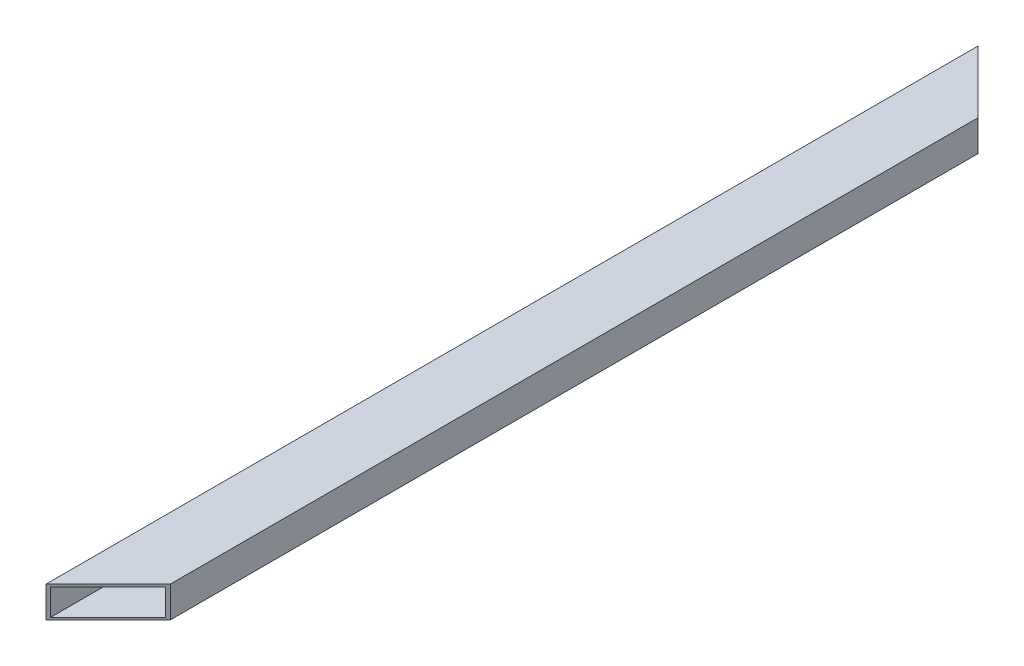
ISO-10303-21;
HEADER;
FILE_DESCRIPTION(('STEP AP214'),'2;1');
FILE_NAME('part.step','',(''),(''),'','','');
FILE_SCHEMA(('AUTOMOTIVE_DESIGN { 1 0 10303 214 1 1 1 1 }'));
ENDSEC;
DATA;
#1=APPLICATION_CONTEXT('core data for automotive mechanical design processes');
#2=APPLICATION_PROTOCOL_DEFINITION('international standard','automotive_design',2000,#1);
#3=PRODUCT_CONTEXT('',#1,'mechanical');
#4=PRODUCT('Part','Part','',(#3));
#5=PRODUCT_RELATED_PRODUCT_CATEGORY('part','',(#4));
#6=PRODUCT_DEFINITION_FORMATION('','',#4);
#7=PRODUCT_DEFINITION_CONTEXT('part definition',#1,'design');
#8=PRODUCT_DEFINITION('design','',#6,#7);
#9=PRODUCT_DEFINITION_SHAPE('','',#8);
#10=(LENGTH_UNIT() NAMED_UNIT(*) SI_UNIT(.MILLI.,.METRE.));
#11=(NAMED_UNIT(*) PLANE_ANGLE_UNIT() SI_UNIT($,.RADIAN.));
#12=(NAMED_UNIT(*) SI_UNIT($,.STERADIAN.) SOLID_ANGLE_UNIT());
#13=UNCERTAINTY_MEASURE_WITH_UNIT(LENGTH_MEASURE(1.E-05),#10,'distance_accuracy_value','');
#14=(GEOMETRIC_REPRESENTATION_CONTEXT(3) GLOBAL_UNCERTAINTY_ASSIGNED_CONTEXT((#13)) GLOBAL_UNIT_ASSIGNED_CONTEXT((#10,
#11,#12)) REPRESENTATION_CONTEXT('',''));
#15=CARTESIAN_POINT('',(0.,0.,0.));
#16=DIRECTION('',(0.,0.,1.));
#17=DIRECTION('',(1.,0.,0.));
#18=AXIS2_PLACEMENT_3D('',#15,#16,#17);
#19=CARTESIAN_POINT('',(0.,0.,1200.));
#20=DIRECTION('',(1.,0.,0.));
#21=DIRECTION('',(0.,1.,0.));
#22=AXIS2_PLACEMENT_3D('',#19,#20,#21);
#23=PLANE('',#22);
#24=DIRECTION('',(0.,-1.,0.));
#25=VECTOR('',#24,1.);
#26=CARTESIAN_POINT('',(0.,0.,0.));
#27=LINE('',#26,#25);
#28=CARTESIAN_POINT('',(0.,40.,0.));
#29=VERTEX_POINT('',#28);
#30=CARTESIAN_POINT('',(0.,0.,0.));
#31=VERTEX_POINT('',#30);
#32=EDGE_CURVE('E88',#29,#31,#27,.T.);
#33=ORIENTED_EDGE('',*,*,#32,.T.);
#34=DIRECTION('',(0.,0.,-1.));
#35=VECTOR('',#34,1.);
#36=CARTESIAN_POINT('',(0.,0.,1200.));
#37=LINE('',#36,#35);
#38=CARTESIAN_POINT('',(0.,0.,1200.));
#39=VERTEX_POINT('',#38);
#40=EDGE_CURVE('E124',#39,#31,#37,.T.);
#41=ORIENTED_EDGE('',*,*,#40,.F.);
#42=DIRECTION('',(0.,-1.,0.));
#43=VECTOR('',#42,1.);
#44=CARTESIAN_POINT('',(0.,0.,1200.));
#45=LINE('',#44,#43);
#46=CARTESIAN_POINT('',(0.,40.,1200.));
#47=VERTEX_POINT('',#46);
#48=EDGE_CURVE('E134',#47,#39,#45,.T.);
#49=ORIENTED_EDGE('',*,*,#48,.F.);
#50=DIRECTION('',(0.,0.,-1.));
#51=VECTOR('',#50,1.);
#52=CARTESIAN_POINT('',(0.,40.,1200.));
#53=LINE('',#52,#51);
#54=EDGE_CURVE('E131',#47,#29,#53,.T.);
#55=ORIENTED_EDGE('',*,*,#54,.T.);
#56=EDGE_LOOP('',(#33,#41,#49,#55));
#57=FACE_BOUND('',#56,.T.);
#58=ADVANCED_FACE('F32',(#57),#23,.F.);
#59=CARTESIAN_POINT('',(0.,0.,1200.));
#60=DIRECTION('',(0.,1.,0.));
#61=DIRECTION('',(0.,0.,1.));
#62=AXIS2_PLACEMENT_3D('',#59,#60,#61);
#63=PLANE('',#62);
#64=ORIENTED_EDGE('',*,*,#40,.T.);
#65=DIRECTION('',(0.707106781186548,0.,0.707106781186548));
#66=VECTOR('',#65,1.);
#67=CARTESIAN_POINT('',(80.,0.,80.0000000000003));
#68=LINE('',#67,#66);
#69=CARTESIAN_POINT('',(80.0000000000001,0.,80.0000000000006));
#70=VERTEX_POINT('',#69);
#71=EDGE_CURVE('E11',#31,#70,#68,.T.);
#72=ORIENTED_EDGE('',*,*,#71,.T.);
#73=DIRECTION('',(0.,0.,-1.));
#74=VECTOR('',#73,1.);
#75=CARTESIAN_POINT('',(80.,0.,1200.));
#76=LINE('',#75,#74);
#77=CARTESIAN_POINT('',(80.,0.,1120.));
#78=VERTEX_POINT('',#77);
#79=EDGE_CURVE('E126',#78,#70,#76,.T.);
#80=ORIENTED_EDGE('',*,*,#79,.F.);
#81=DIRECTION('',(0.707106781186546,0.,-0.707106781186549));
#82=VECTOR('',#81,1.);
#83=CARTESIAN_POINT('',(-1.94289029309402E-13,0.,1200.));
#84=LINE('',#83,#82);
#85=EDGE_CURVE('E107',#78,#39,#84,.F.);
#86=ORIENTED_EDGE('',*,*,#85,.T.);
#87=EDGE_LOOP('',(#64,#72,#80,#86));
#88=FACE_BOUND('',#87,.T.);
#89=ADVANCED_FACE('F166',(#88),#63,.F.);
#90=CARTESIAN_POINT('',(80.,0.,1200.));
#91=DIRECTION('',(-1.,0.,0.));
#92=DIRECTION('',(0.,0.,1.));
#93=AXIS2_PLACEMENT_3D('',#90,#91,#92);
#94=PLANE('',#93);
#95=ORIENTED_EDGE('',*,*,#79,.T.);
#96=DIRECTION('',(0.,1.,0.));
#97=VECTOR('',#96,1.);
#98=CARTESIAN_POINT('',(80.,40.,80.0000000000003));
#99=LINE('',#98,#97);
#100=CARTESIAN_POINT('',(80.0000000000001,40.,80.0000000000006));
#101=VERTEX_POINT('',#100);
#102=EDGE_CURVE('E104',#70,#101,#99,.T.);
#103=ORIENTED_EDGE('',*,*,#102,.T.);
#104=DIRECTION('',(0.,0.,-1.));
#105=VECTOR('',#104,1.);
#106=CARTESIAN_POINT('',(80.,40.,1200.));
#107=LINE('',#106,#105);
#108=CARTESIAN_POINT('',(80.,40.,1120.));
#109=VERTEX_POINT('',#108);
#110=EDGE_CURVE('E128',#109,#101,#107,.T.);
#111=ORIENTED_EDGE('',*,*,#110,.F.);
#112=DIRECTION('',(0.,-1.,0.));
#113=VECTOR('',#112,1.);
#114=CARTESIAN_POINT('',(80.,0.,1120.));
#115=LINE('',#114,#113);
#116=EDGE_CURVE('E118',#109,#78,#115,.T.);
#117=ORIENTED_EDGE('',*,*,#116,.T.);
#118=EDGE_LOOP('',(#95,#103,#111,#117));
#119=FACE_BOUND('',#118,.T.);
#120=ADVANCED_FACE('F176',(#119),#94,.F.);
#121=CARTESIAN_POINT('',(0.,40.,1200.));
#122=DIRECTION('',(0.,-1.,0.));
#123=DIRECTION('',(0.,0.,-1.));
#124=AXIS2_PLACEMENT_3D('',#121,#122,#123);
#125=PLANE('',#124);
#126=ORIENTED_EDGE('',*,*,#110,.T.);
#127=DIRECTION('',(-0.707106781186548,0.,-0.707106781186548));
#128=VECTOR('',#127,1.);
#129=CARTESIAN_POINT('',(80.,40.,80.0000000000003));
#130=LINE('',#129,#128);
#131=EDGE_CURVE('E42',#101,#29,#130,.T.);
#132=ORIENTED_EDGE('',*,*,#131,.T.);
#133=ORIENTED_EDGE('',*,*,#54,.F.);
#134=DIRECTION('',(-0.707106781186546,0.,0.707106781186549));
#135=VECTOR('',#134,1.);
#136=CARTESIAN_POINT('',(-1.94289029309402E-13,40.,1200.));
#137=LINE('',#136,#135);
#138=EDGE_CURVE('E121',#47,#109,#137,.F.);
#139=ORIENTED_EDGE('',*,*,#138,.T.);
#140=EDGE_LOOP('',(#126,#132,#133,#139));
#141=FACE_BOUND('',#140,.T.);
#142=ADVANCED_FACE('F179',(#141),#125,.F.);
#143=CARTESIAN_POINT('',(2.99999999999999,37.,1200.));
#144=DIRECTION('',(1.,0.,0.));
#145=DIRECTION('',(0.,1.,0.));
#146=AXIS2_PLACEMENT_3D('',#143,#144,#145);
#147=PLANE('',#146);
#148=DIRECTION('',(0.,-1.,0.));
#149=VECTOR('',#148,1.);
#150=CARTESIAN_POINT('',(3.,0.,3.00000000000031));
#151=LINE('',#150,#149);
#152=CARTESIAN_POINT('',(2.99999999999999,37.,3.00000000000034));
#153=VERTEX_POINT('',#152);
#154=CARTESIAN_POINT('',(3.,3.,3.00000000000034));
#155=VERTEX_POINT('',#154);
#156=EDGE_CURVE('E36',#153,#155,#151,.T.);
#157=ORIENTED_EDGE('',*,*,#156,.F.);
#158=DIRECTION('',(0.,0.,-1.));
#159=VECTOR('',#158,1.);
#160=CARTESIAN_POINT('',(2.99999999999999,37.,1200.));
#161=LINE('',#160,#159);
#162=CARTESIAN_POINT('',(2.99999999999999,37.,1197.));
#163=VERTEX_POINT('',#162);
#164=EDGE_CURVE('E111',#163,#153,#161,.T.);
#165=ORIENTED_EDGE('',*,*,#164,.F.);
#166=DIRECTION('',(0.,1.,0.));
#167=VECTOR('',#166,1.);
#168=CARTESIAN_POINT('',(2.99999999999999,37.,1197.));
#169=LINE('',#168,#167);
#170=CARTESIAN_POINT('',(3.,3.,1197.));
#171=VERTEX_POINT('',#170);
#172=EDGE_CURVE('E87',#163,#171,#169,.F.);
#173=ORIENTED_EDGE('',*,*,#172,.T.);
#174=DIRECTION('',(0.,0.,-1.));
#175=VECTOR('',#174,1.);
#176=CARTESIAN_POINT('',(3.,3.,1200.));
#177=LINE('',#176,#175);
#178=EDGE_CURVE('E71',#171,#155,#177,.T.);
#179=ORIENTED_EDGE('',*,*,#178,.T.);
#180=EDGE_LOOP('',(#157,#165,#173,#179));
#181=FACE_BOUND('',#180,.T.);
#182=ADVANCED_FACE('F83',(#181),#147,.T.);
#183=CARTESIAN_POINT('',(3.,3.,1200.));
#184=DIRECTION('',(0.,1.,0.));
#185=DIRECTION('',(0.,0.,1.));
#186=AXIS2_PLACEMENT_3D('',#183,#184,#185);
#187=PLANE('',#186);
#188=DIRECTION('',(0.707106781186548,0.,0.707106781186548));
#189=VECTOR('',#188,1.);
#190=CARTESIAN_POINT('',(80.,3.,80.0000000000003));
#191=LINE('',#190,#189);
#192=CARTESIAN_POINT('',(77.,3.,77.0000000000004));
#193=VERTEX_POINT('',#192);
#194=EDGE_CURVE('E67',#155,#193,#191,.T.);
#195=ORIENTED_EDGE('',*,*,#194,.F.);
#196=ORIENTED_EDGE('',*,*,#178,.F.);
#197=DIRECTION('',(-0.707106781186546,0.,0.707106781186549));
#198=VECTOR('',#197,1.);
#199=CARTESIAN_POINT('',(1.4999999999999,3.,1198.5));
#200=LINE('',#199,#198);
#201=CARTESIAN_POINT('',(77.,3.,1123.));
#202=VERTEX_POINT('',#201);
#203=EDGE_CURVE('E98',#171,#202,#200,.F.);
#204=ORIENTED_EDGE('',*,*,#203,.T.);
#205=DIRECTION('',(0.,0.,-1.));
#206=VECTOR('',#205,1.);
#207=CARTESIAN_POINT('',(77.,3.,1200.));
#208=LINE('',#207,#206);
#209=EDGE_CURVE('E74',#202,#193,#208,.T.);
#210=ORIENTED_EDGE('',*,*,#209,.T.);
#211=EDGE_LOOP('',(#195,#196,#204,#210));
#212=FACE_BOUND('',#211,.T.);
#213=ADVANCED_FACE('F69',(#212),#187,.T.);
#214=CARTESIAN_POINT('',(77.,37.,1200.));
#215=DIRECTION('',(-1.,0.,0.));
#216=DIRECTION('',(0.,0.,1.));
#217=AXIS2_PLACEMENT_3D('',#214,#215,#216);
#218=PLANE('',#217);
#219=DIRECTION('',(0.,1.,0.));
#220=VECTOR('',#219,1.);
#221=CARTESIAN_POINT('',(77.,0.,77.0000000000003));
#222=LINE('',#221,#220);
#223=CARTESIAN_POINT('',(77.,37.,77.0000000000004));
#224=VERTEX_POINT('',#223);
#225=EDGE_CURVE('E79',#193,#224,#222,.T.);
#226=ORIENTED_EDGE('',*,*,#225,.F.);
#227=ORIENTED_EDGE('',*,*,#209,.F.);
#228=DIRECTION('',(0.,-1.,0.));
#229=VECTOR('',#228,1.);
#230=CARTESIAN_POINT('',(77.,37.,1123.));
#231=LINE('',#230,#229);
#232=CARTESIAN_POINT('',(77.,37.,1123.));
#233=VERTEX_POINT('',#232);
#234=EDGE_CURVE('E112',#202,#233,#231,.F.);
#235=ORIENTED_EDGE('',*,*,#234,.T.);
#236=DIRECTION('',(0.,0.,-1.));
#237=VECTOR('',#236,1.);
#238=CARTESIAN_POINT('',(77.,37.,1200.));
#239=LINE('',#238,#237);
#240=EDGE_CURVE('E140',#233,#224,#239,.T.);
#241=ORIENTED_EDGE('',*,*,#240,.T.);
#242=EDGE_LOOP('',(#226,#227,#235,#241));
#243=FACE_BOUND('',#242,.T.);
#244=ADVANCED_FACE('F153',(#243),#218,.T.);
#245=CARTESIAN_POINT('',(2.99999999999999,37.,1200.));
#246=DIRECTION('',(0.,-1.,0.));
#247=DIRECTION('',(0.,0.,-1.));
#248=AXIS2_PLACEMENT_3D('',#245,#246,#247);
#249=PLANE('',#248);
#250=DIRECTION('',(-0.707106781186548,0.,-0.707106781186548));
#251=VECTOR('',#250,1.);
#252=CARTESIAN_POINT('',(80.,37.,80.0000000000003));
#253=LINE('',#252,#251);
#254=EDGE_CURVE('E92',#224,#153,#253,.T.);
#255=ORIENTED_EDGE('',*,*,#254,.F.);
#256=ORIENTED_EDGE('',*,*,#240,.F.);
#257=DIRECTION('',(0.707106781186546,0.,-0.707106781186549));
#258=VECTOR('',#257,1.);
#259=CARTESIAN_POINT('',(1.49999999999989,37.,1198.5));
#260=LINE('',#259,#258);
#261=EDGE_CURVE('E108',#233,#163,#260,.F.);
#262=ORIENTED_EDGE('',*,*,#261,.T.);
#263=ORIENTED_EDGE('',*,*,#164,.T.);
#264=EDGE_LOOP('',(#255,#256,#262,#263));
#265=FACE_BOUND('',#264,.T.);
#266=ADVANCED_FACE('F142',(#265),#249,.T.);
#267=CARTESIAN_POINT('',(-1.94289029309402E-13,40.,1200.));
#268=DIRECTION('',(-0.707106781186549,0.,-0.707106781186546));
#269=DIRECTION('',(-0.707106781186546,0.,0.707106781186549));
#270=AXIS2_PLACEMENT_3D('',#267,#268,#269);
#271=PLANE('',#270);
#272=ORIENTED_EDGE('',*,*,#85,.F.);
#273=ORIENTED_EDGE('',*,*,#116,.F.);
#274=ORIENTED_EDGE('',*,*,#138,.F.);
#275=ORIENTED_EDGE('',*,*,#48,.T.);
#276=EDGE_LOOP('',(#272,#273,#274,#275));
#277=FACE_BOUND('',#276,.T.);
#278=ORIENTED_EDGE('',*,*,#172,.F.);
#279=ORIENTED_EDGE('',*,*,#261,.F.);
#280=ORIENTED_EDGE('',*,*,#234,.F.);
#281=ORIENTED_EDGE('',*,*,#203,.F.);
#282=EDGE_LOOP('',(#278,#279,#280,#281));
#283=FACE_BOUND('',#282,.T.);
#284=ADVANCED_FACE('F148',(#277,#283),#271,.F.);
#285=CARTESIAN_POINT('',(80.,0.,80.0000000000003));
#286=DIRECTION('',(0.707106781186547,0.,-0.707106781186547));
#287=DIRECTION('',(-0.707106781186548,0.,-0.707106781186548));
#288=AXIS2_PLACEMENT_3D('',#285,#286,#287);
#289=PLANE('',#288);
#290=ORIENTED_EDGE('',*,*,#71,.F.);
#291=ORIENTED_EDGE('',*,*,#32,.F.);
#292=ORIENTED_EDGE('',*,*,#131,.F.);
#293=ORIENTED_EDGE('',*,*,#102,.F.);
#294=EDGE_LOOP('',(#290,#291,#292,#293));
#295=FACE_BOUND('',#294,.T.);
#296=ORIENTED_EDGE('',*,*,#254,.T.);
#297=ORIENTED_EDGE('',*,*,#156,.T.);
#298=ORIENTED_EDGE('',*,*,#194,.T.);
#299=ORIENTED_EDGE('',*,*,#225,.T.);
#300=EDGE_LOOP('',(#296,#297,#298,#299));
#301=FACE_BOUND('',#300,.T.);
#302=ADVANCED_FACE('F34',(#295,#301),#289,.T.);
#303=CLOSED_SHELL('',(#58,#89,#120,#142,#182,#213,#244,#266,#284,#302));
#304=MANIFOLD_SOLID_BREP('B2',#303);
#305=ADVANCED_BREP_SHAPE_REPRESENTATION('',(#18,#304),#14);
#306=SHAPE_DEFINITION_REPRESENTATION(#9,#305);
ENDSEC;
END-ISO-10303-21;
